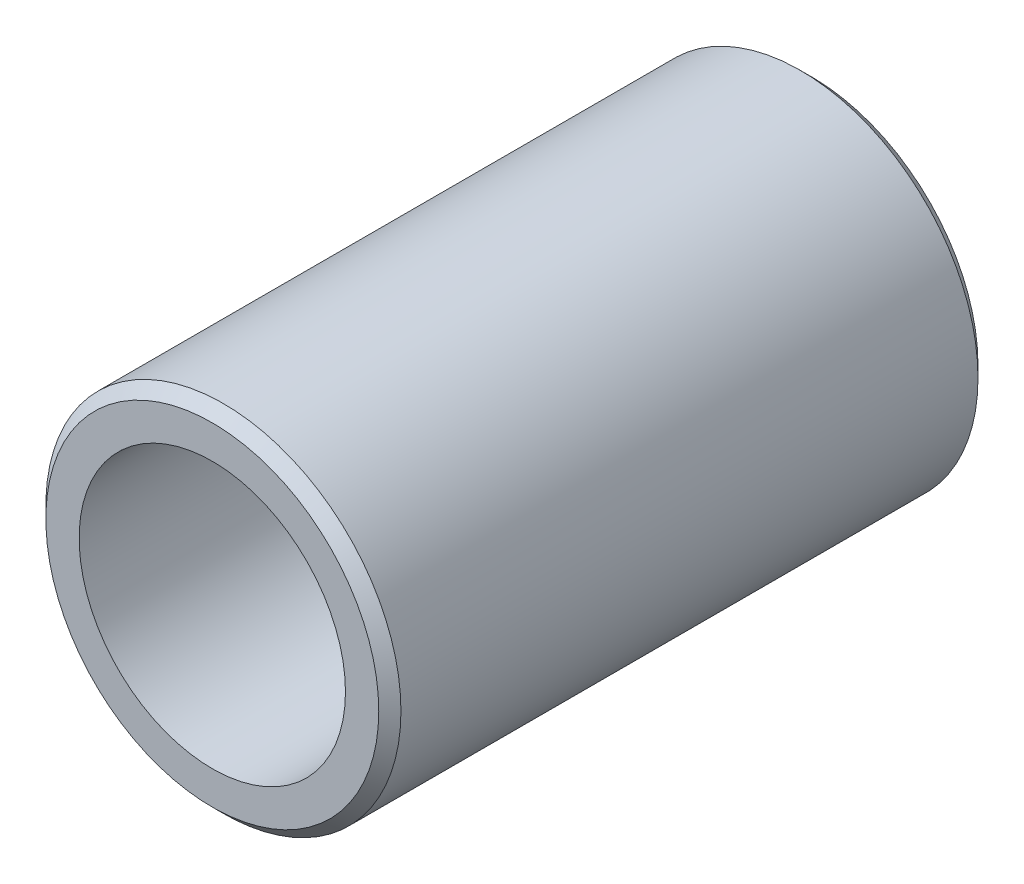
from build123d import *

# Parameters (mm, degrees)
ESQUISSE1_R      = 8
ESQUISSE1_R_2    = 6
EXTRUSION1_DEPTH = 27
CHANFREIN1_SIZE  = 0.5


with BuildPart() as part:
    # Esquisse1 → Extrusion1 (new body)
    with BuildSketch(Plane.XY):
        Circle(ESQUISSE1_R)
        Circle(ESQUISSE1_R_2, mode=Mode.SUBTRACT)
    extrude(amount=EXTRUSION1_DEPTH)

    # Chanfrein1
    chanfrein1_edges = [part.edges().sort_by_distance(p)[0] for p in [
        (-8, 0, 0),
        (-8, 0, 27),
    ]]
    chamfer(chanfrein1_edges, length=CHANFREIN1_SIZE)


solid = part.part
